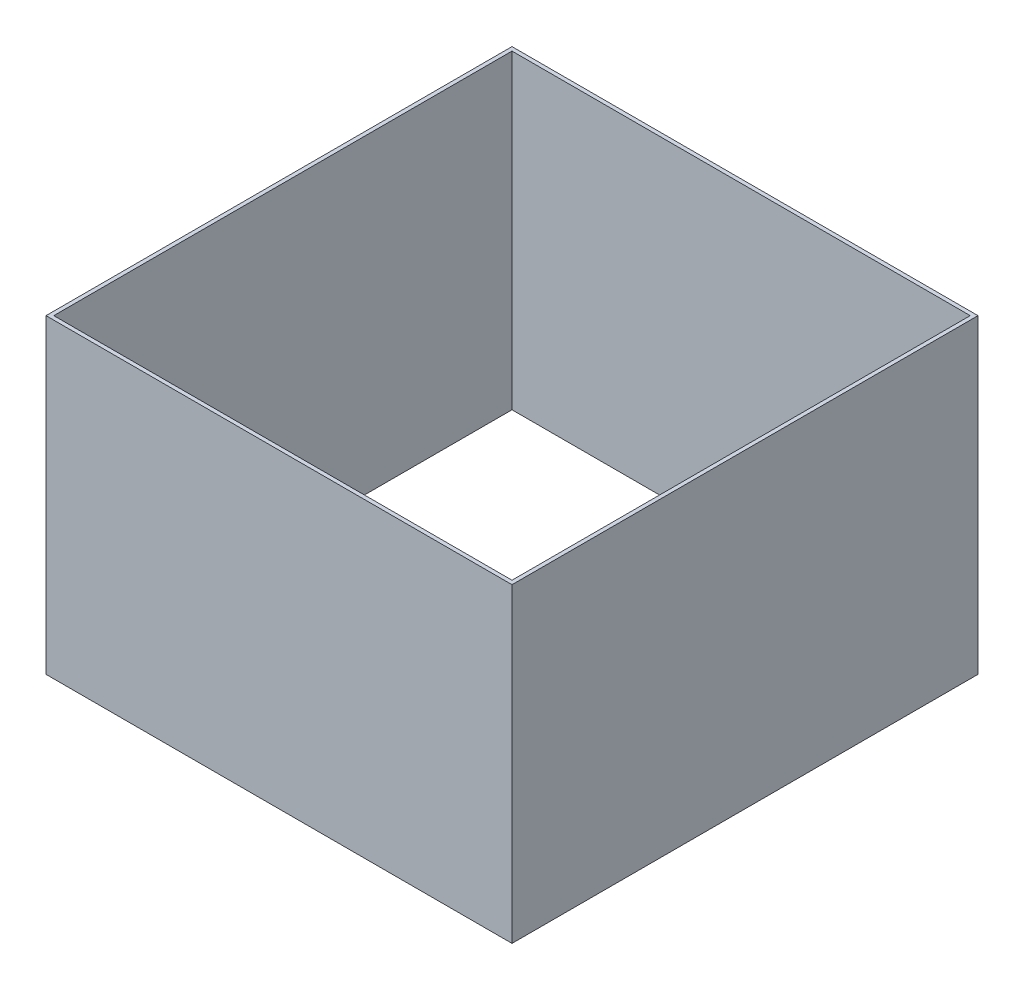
ISO-10303-21;
HEADER;
FILE_DESCRIPTION(('STEP AP214'),'2;1');
FILE_NAME('part.step','',(''),(''),'','','');
FILE_SCHEMA(('AUTOMOTIVE_DESIGN { 1 0 10303 214 1 1 1 1 }'));
ENDSEC;
DATA;
#1=APPLICATION_CONTEXT('core data for automotive mechanical design processes');
#2=APPLICATION_PROTOCOL_DEFINITION('international standard','automotive_design',2000,#1);
#3=PRODUCT_CONTEXT('',#1,'mechanical');
#4=PRODUCT('Part','Part','',(#3));
#5=PRODUCT_RELATED_PRODUCT_CATEGORY('part','',(#4));
#6=PRODUCT_DEFINITION_FORMATION('','',#4);
#7=PRODUCT_DEFINITION_CONTEXT('part definition',#1,'design');
#8=PRODUCT_DEFINITION('design','',#6,#7);
#9=PRODUCT_DEFINITION_SHAPE('','',#8);
#10=(LENGTH_UNIT() NAMED_UNIT(*) SI_UNIT(.MILLI.,.METRE.));
#11=(NAMED_UNIT(*) PLANE_ANGLE_UNIT() SI_UNIT($,.RADIAN.));
#12=(NAMED_UNIT(*) SI_UNIT($,.STERADIAN.) SOLID_ANGLE_UNIT());
#13=UNCERTAINTY_MEASURE_WITH_UNIT(LENGTH_MEASURE(1.E-05),#10,'distance_accuracy_value','');
#14=(GEOMETRIC_REPRESENTATION_CONTEXT(3) GLOBAL_UNCERTAINTY_ASSIGNED_CONTEXT((#13)) GLOBAL_UNIT_ASSIGNED_CONTEXT((#10,
#11,#12)) REPRESENTATION_CONTEXT('',''));
#15=CARTESIAN_POINT('',(0.,0.,0.));
#16=DIRECTION('',(0.,0.,1.));
#17=DIRECTION('',(1.,0.,0.));
#18=AXIS2_PLACEMENT_3D('',#15,#16,#17);
#19=CARTESIAN_POINT('',(0.,203.2,0.));
#20=DIRECTION('',(0.,-1.,0.));
#21=DIRECTION('',(0.,0.,-1.));
#22=AXIS2_PLACEMENT_3D('',#19,#20,#21);
#23=PLANE('',#22);
#24=DIRECTION('',(0.,0.,1.));
#25=VECTOR('',#24,1.);
#26=CARTESIAN_POINT('',(-152.4,203.2,-152.4));
#27=LINE('',#26,#25);
#28=CARTESIAN_POINT('',(-152.4,203.2,-152.4));
#29=VERTEX_POINT('',#28);
#30=CARTESIAN_POINT('',(-152.4,203.2,152.4));
#31=VERTEX_POINT('',#30);
#32=EDGE_CURVE('E138',#29,#31,#27,.T.);
#33=ORIENTED_EDGE('',*,*,#32,.T.);
#34=DIRECTION('',(1.,0.,0.));
#35=VECTOR('',#34,1.);
#36=CARTESIAN_POINT('',(152.4,203.2,152.4));
#37=LINE('',#36,#35);
#38=CARTESIAN_POINT('',(152.4,203.2,152.4));
#39=VERTEX_POINT('',#38);
#40=EDGE_CURVE('E141',#31,#39,#37,.T.);
#41=ORIENTED_EDGE('',*,*,#40,.T.);
#42=DIRECTION('',(0.,0.,-1.));
#43=VECTOR('',#42,1.);
#44=CARTESIAN_POINT('',(152.4,203.2,-152.4));
#45=LINE('',#44,#43);
#46=CARTESIAN_POINT('',(152.4,203.2,-152.4));
#47=VERTEX_POINT('',#46);
#48=EDGE_CURVE('E144',#39,#47,#45,.T.);
#49=ORIENTED_EDGE('',*,*,#48,.T.);
#50=DIRECTION('',(-1.,0.,0.));
#51=VECTOR('',#50,1.);
#52=CARTESIAN_POINT('',(152.4,203.2,-152.4));
#53=LINE('',#52,#51);
#54=EDGE_CURVE('E146',#47,#29,#53,.T.);
#55=ORIENTED_EDGE('',*,*,#54,.T.);
#56=EDGE_LOOP('',(#33,#41,#49,#55));
#57=FACE_BOUND('',#56,.T.);
#58=DIRECTION('',(-1.,0.,0.));
#59=VECTOR('',#58,1.);
#60=CARTESIAN_POINT('',(149.86,203.2,-149.86));
#61=LINE('',#60,#59);
#62=CARTESIAN_POINT('',(149.86,203.2,-149.86));
#63=VERTEX_POINT('',#62);
#64=CARTESIAN_POINT('',(-149.86,203.2,-149.86));
#65=VERTEX_POINT('',#64);
#66=EDGE_CURVE('E102',#63,#65,#61,.T.);
#67=ORIENTED_EDGE('',*,*,#66,.F.);
#68=DIRECTION('',(0.,0.,-1.));
#69=VECTOR('',#68,1.);
#70=CARTESIAN_POINT('',(149.86,203.2,-149.86));
#71=LINE('',#70,#69);
#72=CARTESIAN_POINT('',(149.86,203.2,149.86));
#73=VERTEX_POINT('',#72);
#74=EDGE_CURVE('E124',#73,#63,#71,.T.);
#75=ORIENTED_EDGE('',*,*,#74,.F.);
#76=DIRECTION('',(1.,0.,0.));
#77=VECTOR('',#76,1.);
#78=CARTESIAN_POINT('',(149.86,203.2,149.86));
#79=LINE('',#78,#77);
#80=CARTESIAN_POINT('',(-149.86,203.2,149.86));
#81=VERTEX_POINT('',#80);
#82=EDGE_CURVE('E122',#81,#73,#79,.T.);
#83=ORIENTED_EDGE('',*,*,#82,.F.);
#84=DIRECTION('',(0.,0.,1.));
#85=VECTOR('',#84,1.);
#86=CARTESIAN_POINT('',(-149.86,203.2,-149.86));
#87=LINE('',#86,#85);
#88=EDGE_CURVE('E110',#65,#81,#87,.T.);
#89=ORIENTED_EDGE('',*,*,#88,.F.);
#90=EDGE_LOOP('',(#67,#75,#83,#89));
#91=FACE_BOUND('',#90,.T.);
#92=ADVANCED_FACE('F37',(#57,#91),#23,.F.);
#93=CARTESIAN_POINT('',(0.,0.,0.));
#94=DIRECTION('',(0.,-1.,0.));
#95=DIRECTION('',(0.,0.,-1.));
#96=AXIS2_PLACEMENT_3D('',#93,#94,#95);
#97=PLANE('',#96);
#98=DIRECTION('',(0.,0.,1.));
#99=VECTOR('',#98,1.);
#100=CARTESIAN_POINT('',(-152.4,0.,-152.4));
#101=LINE('',#100,#99);
#102=CARTESIAN_POINT('',(-152.4,0.,-152.4));
#103=VERTEX_POINT('',#102);
#104=CARTESIAN_POINT('',(-152.4,0.,152.4));
#105=VERTEX_POINT('',#104);
#106=EDGE_CURVE('E118',#103,#105,#101,.T.);
#107=ORIENTED_EDGE('',*,*,#106,.F.);
#108=DIRECTION('',(-1.,0.,0.));
#109=VECTOR('',#108,1.);
#110=CARTESIAN_POINT('',(152.4,0.,-152.4));
#111=LINE('',#110,#109);
#112=CARTESIAN_POINT('',(152.4,0.,-152.4));
#113=VERTEX_POINT('',#112);
#114=EDGE_CURVE('E142',#113,#103,#111,.T.);
#115=ORIENTED_EDGE('',*,*,#114,.F.);
#116=DIRECTION('',(0.,0.,-1.));
#117=VECTOR('',#116,1.);
#118=CARTESIAN_POINT('',(152.4,0.,-152.4));
#119=LINE('',#118,#117);
#120=CARTESIAN_POINT('',(152.4,0.,152.4));
#121=VERTEX_POINT('',#120);
#122=EDGE_CURVE('E153',#121,#113,#119,.T.);
#123=ORIENTED_EDGE('',*,*,#122,.F.);
#124=DIRECTION('',(1.,0.,0.));
#125=VECTOR('',#124,1.);
#126=CARTESIAN_POINT('',(152.4,0.,152.4));
#127=LINE('',#126,#125);
#128=EDGE_CURVE('E151',#105,#121,#127,.T.);
#129=ORIENTED_EDGE('',*,*,#128,.F.);
#130=EDGE_LOOP('',(#107,#115,#123,#129));
#131=FACE_BOUND('',#130,.T.);
#132=DIRECTION('',(0.,0.,-1.));
#133=VECTOR('',#132,1.);
#134=CARTESIAN_POINT('',(149.86,0.,-149.86));
#135=LINE('',#134,#133);
#136=CARTESIAN_POINT('',(149.86,0.,149.86));
#137=VERTEX_POINT('',#136);
#138=CARTESIAN_POINT('',(149.86,0.,-149.86));
#139=VERTEX_POINT('',#138);
#140=EDGE_CURVE('E111',#137,#139,#135,.T.);
#141=ORIENTED_EDGE('',*,*,#140,.T.);
#142=DIRECTION('',(-1.,0.,0.));
#143=VECTOR('',#142,1.);
#144=CARTESIAN_POINT('',(149.86,0.,-149.86));
#145=LINE('',#144,#143);
#146=CARTESIAN_POINT('',(-149.86,0.,-149.86));
#147=VERTEX_POINT('',#146);
#148=EDGE_CURVE('E60',#139,#147,#145,.T.);
#149=ORIENTED_EDGE('',*,*,#148,.T.);
#150=DIRECTION('',(0.,0.,1.));
#151=VECTOR('',#150,1.);
#152=CARTESIAN_POINT('',(-149.86,0.,-149.86));
#153=LINE('',#152,#151);
#154=CARTESIAN_POINT('',(-149.86,0.,149.86));
#155=VERTEX_POINT('',#154);
#156=EDGE_CURVE('E117',#147,#155,#153,.T.);
#157=ORIENTED_EDGE('',*,*,#156,.T.);
#158=DIRECTION('',(1.,0.,0.));
#159=VECTOR('',#158,1.);
#160=CARTESIAN_POINT('',(149.86,0.,149.86));
#161=LINE('',#160,#159);
#162=EDGE_CURVE('E130',#155,#137,#161,.T.);
#163=ORIENTED_EDGE('',*,*,#162,.T.);
#164=EDGE_LOOP('',(#141,#149,#157,#163));
#165=FACE_BOUND('',#164,.T.);
#166=ADVANCED_FACE('F171',(#131,#165),#97,.T.);
#167=CARTESIAN_POINT('',(-152.4,203.2,-152.4));
#168=DIRECTION('',(1.,0.,0.));
#169=DIRECTION('',(0.,0.,-1.));
#170=AXIS2_PLACEMENT_3D('',#167,#168,#169);
#171=PLANE('',#170);
#172=ORIENTED_EDGE('',*,*,#106,.T.);
#173=DIRECTION('',(0.,-1.,0.));
#174=VECTOR('',#173,1.);
#175=CARTESIAN_POINT('',(-152.4,203.2,152.4));
#176=LINE('',#175,#174);
#177=EDGE_CURVE('E11',#31,#105,#176,.T.);
#178=ORIENTED_EDGE('',*,*,#177,.F.);
#179=ORIENTED_EDGE('',*,*,#32,.F.);
#180=DIRECTION('',(0.,-1.,0.));
#181=VECTOR('',#180,1.);
#182=CARTESIAN_POINT('',(-152.4,203.2,-152.4));
#183=LINE('',#182,#181);
#184=EDGE_CURVE('E148',#29,#103,#183,.T.);
#185=ORIENTED_EDGE('',*,*,#184,.T.);
#186=EDGE_LOOP('',(#172,#178,#179,#185));
#187=FACE_BOUND('',#186,.T.);
#188=ADVANCED_FACE('F39',(#187),#171,.F.);
#189=CARTESIAN_POINT('',(152.4,203.2,152.4));
#190=DIRECTION('',(0.,0.,-1.));
#191=DIRECTION('',(-1.,0.,0.));
#192=AXIS2_PLACEMENT_3D('',#189,#190,#191);
#193=PLANE('',#192);
#194=ORIENTED_EDGE('',*,*,#128,.T.);
#195=DIRECTION('',(0.,-1.,0.));
#196=VECTOR('',#195,1.);
#197=CARTESIAN_POINT('',(152.4,203.2,152.4));
#198=LINE('',#197,#196);
#199=EDGE_CURVE('E45',#39,#121,#198,.T.);
#200=ORIENTED_EDGE('',*,*,#199,.F.);
#201=ORIENTED_EDGE('',*,*,#40,.F.);
#202=ORIENTED_EDGE('',*,*,#177,.T.);
#203=EDGE_LOOP('',(#194,#200,#201,#202));
#204=FACE_BOUND('',#203,.T.);
#205=ADVANCED_FACE('F181',(#204),#193,.F.);
#206=CARTESIAN_POINT('',(152.4,203.2,-152.4));
#207=DIRECTION('',(-1.,0.,0.));
#208=DIRECTION('',(0.,0.,1.));
#209=AXIS2_PLACEMENT_3D('',#206,#207,#208);
#210=PLANE('',#209);
#211=ORIENTED_EDGE('',*,*,#122,.T.);
#212=DIRECTION('',(0.,-1.,0.));
#213=VECTOR('',#212,1.);
#214=CARTESIAN_POINT('',(152.4,203.2,-152.4));
#215=LINE('',#214,#213);
#216=EDGE_CURVE('E158',#47,#113,#215,.T.);
#217=ORIENTED_EDGE('',*,*,#216,.F.);
#218=ORIENTED_EDGE('',*,*,#48,.F.);
#219=ORIENTED_EDGE('',*,*,#199,.T.);
#220=EDGE_LOOP('',(#211,#217,#218,#219));
#221=FACE_BOUND('',#220,.T.);
#222=ADVANCED_FACE('F165',(#221),#210,.F.);
#223=CARTESIAN_POINT('',(152.4,203.2,-152.4));
#224=DIRECTION('',(0.,0.,1.));
#225=DIRECTION('',(1.,0.,0.));
#226=AXIS2_PLACEMENT_3D('',#223,#224,#225);
#227=PLANE('',#226);
#228=ORIENTED_EDGE('',*,*,#114,.T.);
#229=ORIENTED_EDGE('',*,*,#184,.F.);
#230=ORIENTED_EDGE('',*,*,#54,.F.);
#231=ORIENTED_EDGE('',*,*,#216,.T.);
#232=EDGE_LOOP('',(#228,#229,#230,#231));
#233=FACE_BOUND('',#232,.T.);
#234=ADVANCED_FACE('F175',(#233),#227,.F.);
#235=CARTESIAN_POINT('',(149.86,203.2,-149.86));
#236=DIRECTION('',(0.,0.,1.));
#237=DIRECTION('',(1.,0.,0.));
#238=AXIS2_PLACEMENT_3D('',#235,#236,#237);
#239=PLANE('',#238);
#240=ORIENTED_EDGE('',*,*,#148,.F.);
#241=DIRECTION('',(0.,-1.,0.));
#242=VECTOR('',#241,1.);
#243=CARTESIAN_POINT('',(149.86,203.2,-149.86));
#244=LINE('',#243,#242);
#245=EDGE_CURVE('E106',#63,#139,#244,.T.);
#246=ORIENTED_EDGE('',*,*,#245,.F.);
#247=ORIENTED_EDGE('',*,*,#66,.T.);
#248=DIRECTION('',(0.,-1.,0.));
#249=VECTOR('',#248,1.);
#250=CARTESIAN_POINT('',(-149.86,203.2,-149.86));
#251=LINE('',#250,#249);
#252=EDGE_CURVE('E105',#65,#147,#251,.T.);
#253=ORIENTED_EDGE('',*,*,#252,.T.);
#254=EDGE_LOOP('',(#240,#246,#247,#253));
#255=FACE_BOUND('',#254,.T.);
#256=ADVANCED_FACE('F104',(#255),#239,.T.);
#257=CARTESIAN_POINT('',(-149.86,203.2,-149.86));
#258=DIRECTION('',(1.,0.,0.));
#259=DIRECTION('',(0.,0.,-1.));
#260=AXIS2_PLACEMENT_3D('',#257,#258,#259);
#261=PLANE('',#260);
#262=ORIENTED_EDGE('',*,*,#156,.F.);
#263=ORIENTED_EDGE('',*,*,#252,.F.);
#264=ORIENTED_EDGE('',*,*,#88,.T.);
#265=DIRECTION('',(0.,-1.,0.));
#266=VECTOR('',#265,1.);
#267=CARTESIAN_POINT('',(-149.86,203.2,149.86));
#268=LINE('',#267,#266);
#269=EDGE_CURVE('E119',#81,#155,#268,.T.);
#270=ORIENTED_EDGE('',*,*,#269,.T.);
#271=EDGE_LOOP('',(#262,#263,#264,#270));
#272=FACE_BOUND('',#271,.T.);
#273=ADVANCED_FACE('F114',(#272),#261,.T.);
#274=CARTESIAN_POINT('',(149.86,203.2,149.86));
#275=DIRECTION('',(0.,0.,-1.));
#276=DIRECTION('',(-1.,0.,0.));
#277=AXIS2_PLACEMENT_3D('',#274,#275,#276);
#278=PLANE('',#277);
#279=ORIENTED_EDGE('',*,*,#162,.F.);
#280=ORIENTED_EDGE('',*,*,#269,.F.);
#281=ORIENTED_EDGE('',*,*,#82,.T.);
#282=DIRECTION('',(0.,-1.,0.));
#283=VECTOR('',#282,1.);
#284=CARTESIAN_POINT('',(149.86,203.2,149.86));
#285=LINE('',#284,#283);
#286=EDGE_CURVE('E52',#73,#137,#285,.T.);
#287=ORIENTED_EDGE('',*,*,#286,.T.);
#288=EDGE_LOOP('',(#279,#280,#281,#287));
#289=FACE_BOUND('',#288,.T.);
#290=ADVANCED_FACE('F204',(#289),#278,.T.);
#291=CARTESIAN_POINT('',(149.86,203.2,-149.86));
#292=DIRECTION('',(-1.,0.,0.));
#293=DIRECTION('',(0.,0.,1.));
#294=AXIS2_PLACEMENT_3D('',#291,#292,#293);
#295=PLANE('',#294);
#296=ORIENTED_EDGE('',*,*,#140,.F.);
#297=ORIENTED_EDGE('',*,*,#286,.F.);
#298=ORIENTED_EDGE('',*,*,#74,.T.);
#299=ORIENTED_EDGE('',*,*,#245,.T.);
#300=EDGE_LOOP('',(#296,#297,#298,#299));
#301=FACE_BOUND('',#300,.T.);
#302=ADVANCED_FACE('F208',(#301),#295,.T.);
#303=CLOSED_SHELL('',(#92,#166,#188,#205,#222,#234,#256,#273,#290,#302));
#304=MANIFOLD_SOLID_BREP('B2',#303);
#305=ADVANCED_BREP_SHAPE_REPRESENTATION('',(#18,#304),#14);
#306=SHAPE_DEFINITION_REPRESENTATION(#9,#305);
ENDSEC;
END-ISO-10303-21;
